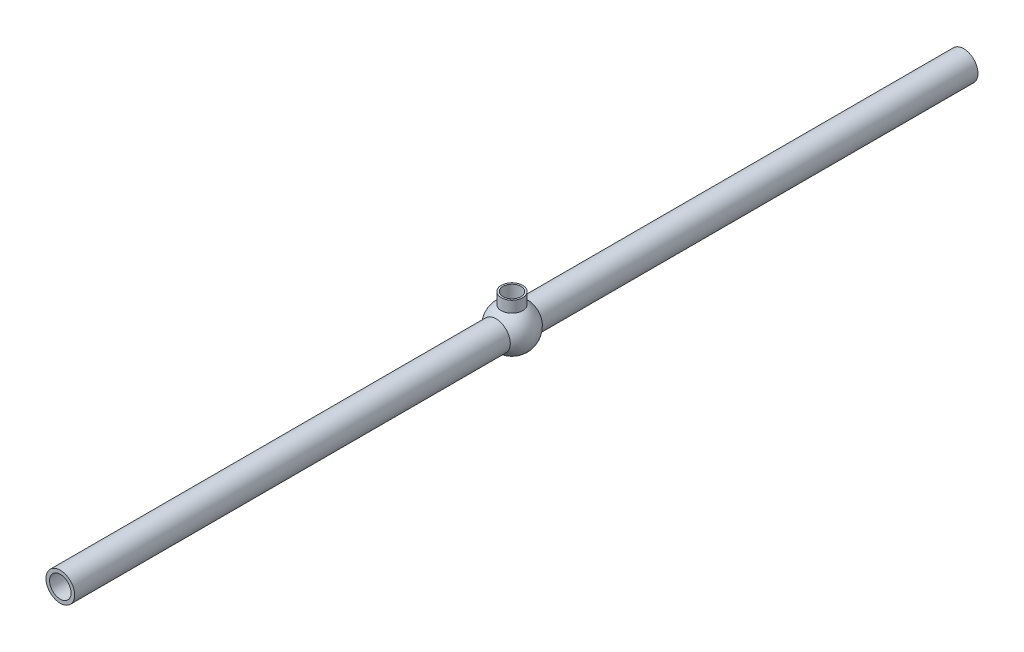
ISO-10303-21;
HEADER;
FILE_DESCRIPTION(('STEP AP214'),'2;1');
FILE_NAME('part.step','',(''),(''),'','','');
FILE_SCHEMA(('AUTOMOTIVE_DESIGN { 1 0 10303 214 1 1 1 1 }'));
ENDSEC;
DATA;
#1=APPLICATION_CONTEXT('core data for automotive mechanical design processes');
#2=APPLICATION_PROTOCOL_DEFINITION('international standard','automotive_design',2000,#1);
#3=PRODUCT_CONTEXT('',#1,'mechanical');
#4=PRODUCT('Part','Part','',(#3));
#5=PRODUCT_RELATED_PRODUCT_CATEGORY('part','',(#4));
#6=PRODUCT_DEFINITION_FORMATION('','',#4);
#7=PRODUCT_DEFINITION_CONTEXT('part definition',#1,'design');
#8=PRODUCT_DEFINITION('design','',#6,#7);
#9=PRODUCT_DEFINITION_SHAPE('','',#8);
#10=(LENGTH_UNIT() NAMED_UNIT(*) SI_UNIT(.MILLI.,.METRE.));
#11=(NAMED_UNIT(*) PLANE_ANGLE_UNIT() SI_UNIT($,.RADIAN.));
#12=(NAMED_UNIT(*) SI_UNIT($,.STERADIAN.) SOLID_ANGLE_UNIT());
#13=UNCERTAINTY_MEASURE_WITH_UNIT(LENGTH_MEASURE(1.E-05),#10,'distance_accuracy_value','');
#14=(GEOMETRIC_REPRESENTATION_CONTEXT(3) GLOBAL_UNCERTAINTY_ASSIGNED_CONTEXT((#13)) GLOBAL_UNIT_ASSIGNED_CONTEXT((#10,
#11,#12)) REPRESENTATION_CONTEXT('',''));
#15=CARTESIAN_POINT('',(0.,0.,0.));
#16=DIRECTION('',(0.,0.,1.));
#17=DIRECTION('',(1.,0.,0.));
#18=AXIS2_PLACEMENT_3D('',#15,#16,#17);
#19=CARTESIAN_POINT('',(0.,0.,0.));
#20=DIRECTION('',(0.,1.,0.));
#21=DIRECTION('',(1.,0.,0.));
#22=AXIS2_PLACEMENT_3D('',#19,#20,#21);
#23=SPHERICAL_SURFACE('',#22,30.);
#24=CARTESIAN_POINT('',(0.,25.9807621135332,0.));
#25=DIRECTION('',(0.,1.,0.));
#26=DIRECTION('',(-1.,0.,0.));
#27=AXIS2_PLACEMENT_3D('',#24,#25,#26);
#28=CIRCLE('',#27,14.9999999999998);
#29=CARTESIAN_POINT('',(-14.9999999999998,25.9807621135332,0.));
#30=VERTEX_POINT('',#29);
#31=EDGE_CURVE('E47',#30,#30,#28,.T.);
#32=ORIENTED_EDGE('',*,*,#31,.F.);
#33=EDGE_LOOP('',(#32));
#34=FACE_BOUND('',#33,.T.);
#35=CARTESIAN_POINT('',(0.,0.,22.3606797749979));
#36=DIRECTION('',(0.,0.,-1.));
#37=DIRECTION('',(-1.,0.,0.));
#38=AXIS2_PLACEMENT_3D('',#35,#36,#37);
#39=CIRCLE('',#38,20.);
#40=CARTESIAN_POINT('',(-20.,0.,22.3606797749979));
#41=VERTEX_POINT('',#40);
#42=EDGE_CURVE('E63',#41,#41,#39,.F.);
#43=ORIENTED_EDGE('',*,*,#42,.F.);
#44=EDGE_LOOP('',(#43));
#45=FACE_BOUND('',#44,.T.);
#46=CARTESIAN_POINT('',(0.,0.,-22.3606797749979));
#47=DIRECTION('',(0.,0.,1.));
#48=DIRECTION('',(1.,0.,0.));
#49=AXIS2_PLACEMENT_3D('',#46,#47,#48);
#50=CIRCLE('',#49,20.);
#51=CARTESIAN_POINT('',(20.,0.,-22.3606797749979));
#52=VERTEX_POINT('',#51);
#53=EDGE_CURVE('E11',#52,#52,#50,.F.);
#54=ORIENTED_EDGE('',*,*,#53,.F.);
#55=EDGE_LOOP('',(#54));
#56=FACE_BOUND('',#55,.T.);
#57=ADVANCED_FACE('F41',(#34,#45,#56),#23,.T.);
#58=CARTESIAN_POINT('',(0.,42.0067775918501,0.));
#59=DIRECTION('',(0.,1.,0.));
#60=DIRECTION('',(-1.,0.,0.));
#61=AXIS2_PLACEMENT_3D('',#58,#59,#60);
#62=CYLINDRICAL_SURFACE('',#61,14.9999999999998);
#63=CARTESIAN_POINT('',(0.,41.650635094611,0.));
#64=DIRECTION('',(0.,1.,0.));
#65=DIRECTION('',(-1.,0.,0.));
#66=AXIS2_PLACEMENT_3D('',#63,#64,#65);
#67=CIRCLE('',#66,14.9999999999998);
#68=CARTESIAN_POINT('',(-14.9999999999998,41.650635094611,0.));
#69=VERTEX_POINT('',#68);
#70=EDGE_CURVE('E51',#69,#69,#67,.T.);
#71=ORIENTED_EDGE('',*,*,#70,.F.);
#72=EDGE_LOOP('',(#71));
#73=FACE_BOUND('',#72,.T.);
#74=ORIENTED_EDGE('',*,*,#31,.T.);
#75=EDGE_LOOP('',(#74));
#76=FACE_BOUND('',#75,.T.);
#77=ADVANCED_FACE('F109',(#73,#76),#62,.T.);
#78=CARTESIAN_POINT('',(14.9999999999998,41.650635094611,0.));
#79=DIRECTION('',(0.,-1.,0.));
#80=DIRECTION('',(1.,0.,0.));
#81=AXIS2_PLACEMENT_3D('',#78,#79,#80);
#82=PLANE('',#81);
#83=CARTESIAN_POINT('',(0.,41.650635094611,0.));
#84=DIRECTION('',(0.,1.,0.));
#85=DIRECTION('',(-1.,0.,0.));
#86=AXIS2_PLACEMENT_3D('',#83,#84,#85);
#87=CIRCLE('',#86,12.4999999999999);
#88=CARTESIAN_POINT('',(-12.4999999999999,41.650635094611,0.));
#89=VERTEX_POINT('',#88);
#90=EDGE_CURVE('E56',#89,#89,#87,.T.);
#91=ORIENTED_EDGE('',*,*,#90,.F.);
#92=EDGE_LOOP('',(#91));
#93=FACE_BOUND('',#92,.T.);
#94=ORIENTED_EDGE('',*,*,#70,.T.);
#95=EDGE_LOOP('',(#94));
#96=FACE_BOUND('',#95,.T.);
#97=ADVANCED_FACE('F114',(#93,#96),#82,.F.);
#98=CARTESIAN_POINT('',(0.,42.0067775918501,0.));
#99=DIRECTION('',(0.,1.,0.));
#100=DIRECTION('',(-1.,0.,0.));
#101=AXIS2_PLACEMENT_3D('',#98,#99,#100);
#102=CYLINDRICAL_SURFACE('',#101,12.4999999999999);
#103=CARTESIAN_POINT('',(0.,21.650635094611,0.));
#104=DIRECTION('',(0.,1.,0.));
#105=DIRECTION('',(-1.,0.,0.));
#106=AXIS2_PLACEMENT_3D('',#103,#104,#105);
#107=CIRCLE('',#106,12.4999999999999);
#108=CARTESIAN_POINT('',(-12.4999999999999,21.650635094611,0.));
#109=VERTEX_POINT('',#108);
#110=EDGE_CURVE('E65',#109,#109,#107,.T.);
#111=ORIENTED_EDGE('',*,*,#110,.F.);
#112=EDGE_LOOP('',(#111));
#113=FACE_BOUND('',#112,.T.);
#114=ORIENTED_EDGE('',*,*,#90,.T.);
#115=EDGE_LOOP('',(#114));
#116=FACE_BOUND('',#115,.T.);
#117=ADVANCED_FACE('F104',(#113,#116),#102,.F.);
#118=CARTESIAN_POINT('',(0.,0.,0.));
#119=DIRECTION('',(0.,1.,0.));
#120=DIRECTION('',(1.,0.,0.));
#121=AXIS2_PLACEMENT_3D('',#118,#119,#120);
#122=SPHERICAL_SURFACE('',#121,25.);
#123=CARTESIAN_POINT('',(0.,0.,20.));
#124=DIRECTION('',(0.,0.,-1.));
#125=DIRECTION('',(-1.,0.,0.));
#126=AXIS2_PLACEMENT_3D('',#123,#124,#125);
#127=CIRCLE('',#126,15.);
#128=CARTESIAN_POINT('',(15.,0.,20.));
#129=VERTEX_POINT('',#128);
#130=EDGE_CURVE('E62',#129,#129,#127,.F.);
#131=ORIENTED_EDGE('',*,*,#130,.T.);
#132=EDGE_LOOP('',(#131));
#133=FACE_BOUND('',#132,.T.);
#134=CARTESIAN_POINT('',(0.,0.,-20.));
#135=DIRECTION('',(0.,0.,1.));
#136=DIRECTION('',(1.,0.,0.));
#137=AXIS2_PLACEMENT_3D('',#134,#135,#136);
#138=CIRCLE('',#137,15.);
#139=CARTESIAN_POINT('',(15.,0.,-20.));
#140=VERTEX_POINT('',#139);
#141=EDGE_CURVE('E60',#140,#140,#138,.F.);
#142=ORIENTED_EDGE('',*,*,#141,.T.);
#143=EDGE_LOOP('',(#142));
#144=FACE_BOUND('',#143,.T.);
#145=ORIENTED_EDGE('',*,*,#110,.T.);
#146=EDGE_LOOP('',(#145));
#147=FACE_BOUND('',#146,.T.);
#148=ADVANCED_FACE('F95',(#133,#144,#147),#122,.F.);
#149=CARTESIAN_POINT('',(0.,0.,-30.));
#150=DIRECTION('',(0.,0.,1.));
#151=DIRECTION('',(1.,0.,0.));
#152=AXIS2_PLACEMENT_3D('',#149,#150,#151);
#153=CYLINDRICAL_SURFACE('',#152,15.);
#154=CARTESIAN_POINT('',(0.,0.,-630.));
#155=DIRECTION('',(0.,0.,1.));
#156=DIRECTION('',(1.,0.,0.));
#157=AXIS2_PLACEMENT_3D('',#154,#155,#156);
#158=CIRCLE('',#157,15.);
#159=CARTESIAN_POINT('',(15.,0.,-630.));
#160=VERTEX_POINT('',#159);
#161=EDGE_CURVE('E85',#160,#160,#158,.T.);
#162=CARTESIAN_POINT('',(15.,0.,-20.));
#163=CARTESIAN_POINT('',(15.,0.,-26.3541666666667));
#164=CARTESIAN_POINT('',(15.,0.,-32.7083333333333));
#165=CARTESIAN_POINT('',(15.,0.,-45.4166666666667));
#166=CARTESIAN_POINT('',(15.,0.,-51.7708333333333));
#167=CARTESIAN_POINT('',(15.,0.,-64.4791666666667));
#168=CARTESIAN_POINT('',(15.,0.,-70.8333333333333));
#169=CARTESIAN_POINT('',(15.,0.,-83.5416666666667));
#170=CARTESIAN_POINT('',(15.,0.,-89.8958333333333));
#171=CARTESIAN_POINT('',(15.,0.,-102.604166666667));
#172=CARTESIAN_POINT('',(15.,0.,-108.958333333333));
#173=CARTESIAN_POINT('',(15.,0.,-121.666666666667));
#174=CARTESIAN_POINT('',(15.,0.,-128.020833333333));
#175=CARTESIAN_POINT('',(15.,0.,-140.729166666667));
#176=CARTESIAN_POINT('',(15.,0.,-147.083333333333));
#177=CARTESIAN_POINT('',(15.,0.,-159.791666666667));
#178=CARTESIAN_POINT('',(15.,0.,-166.145833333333));
#179=CARTESIAN_POINT('',(15.,0.,-178.854166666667));
#180=CARTESIAN_POINT('',(15.,0.,-185.208333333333));
#181=CARTESIAN_POINT('',(15.,0.,-197.916666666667));
#182=CARTESIAN_POINT('',(15.,0.,-204.270833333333));
#183=CARTESIAN_POINT('',(15.,0.,-216.979166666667));
#184=CARTESIAN_POINT('',(15.,0.,-223.333333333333));
#185=CARTESIAN_POINT('',(15.,0.,-236.041666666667));
#186=CARTESIAN_POINT('',(15.,0.,-242.395833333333));
#187=CARTESIAN_POINT('',(15.,0.,-255.104166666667));
#188=CARTESIAN_POINT('',(15.,0.,-261.458333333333));
#189=CARTESIAN_POINT('',(15.,0.,-274.166666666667));
#190=CARTESIAN_POINT('',(15.,0.,-280.520833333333));
#191=CARTESIAN_POINT('',(15.,0.,-293.229166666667));
#192=CARTESIAN_POINT('',(15.,0.,-299.583333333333));
#193=CARTESIAN_POINT('',(15.,0.,-312.291666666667));
#194=CARTESIAN_POINT('',(15.,0.,-318.645833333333));
#195=CARTESIAN_POINT('',(15.,0.,-331.354166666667));
#196=CARTESIAN_POINT('',(15.,0.,-337.708333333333));
#197=CARTESIAN_POINT('',(15.,0.,-350.416666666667));
#198=CARTESIAN_POINT('',(15.,0.,-356.770833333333));
#199=CARTESIAN_POINT('',(15.,0.,-369.479166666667));
#200=CARTESIAN_POINT('',(15.,0.,-375.833333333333));
#201=CARTESIAN_POINT('',(15.,0.,-388.541666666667));
#202=CARTESIAN_POINT('',(15.,0.,-394.895833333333));
#203=CARTESIAN_POINT('',(15.,0.,-407.604166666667));
#204=CARTESIAN_POINT('',(15.,0.,-413.958333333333));
#205=CARTESIAN_POINT('',(15.,0.,-426.666666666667));
#206=CARTESIAN_POINT('',(15.,0.,-433.020833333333));
#207=CARTESIAN_POINT('',(15.,0.,-445.729166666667));
#208=CARTESIAN_POINT('',(15.,0.,-452.083333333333));
#209=CARTESIAN_POINT('',(15.,0.,-464.791666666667));
#210=CARTESIAN_POINT('',(15.,0.,-471.145833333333));
#211=CARTESIAN_POINT('',(15.,0.,-483.854166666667));
#212=CARTESIAN_POINT('',(15.,0.,-490.208333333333));
#213=CARTESIAN_POINT('',(15.,0.,-502.916666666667));
#214=CARTESIAN_POINT('',(15.,0.,-509.270833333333));
#215=CARTESIAN_POINT('',(15.,0.,-521.979166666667));
#216=CARTESIAN_POINT('',(15.,0.,-528.333333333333));
#217=CARTESIAN_POINT('',(15.,0.,-541.041666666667));
#218=CARTESIAN_POINT('',(15.,0.,-547.395833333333));
#219=CARTESIAN_POINT('',(15.,0.,-560.104166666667));
#220=CARTESIAN_POINT('',(15.,0.,-566.458333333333));
#221=CARTESIAN_POINT('',(15.,0.,-579.166666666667));
#222=CARTESIAN_POINT('',(15.,0.,-585.520833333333));
#223=CARTESIAN_POINT('',(15.,0.,-598.229166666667));
#224=CARTESIAN_POINT('',(15.,0.,-604.583333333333));
#225=CARTESIAN_POINT('',(15.,0.,-617.291666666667));
#226=CARTESIAN_POINT('',(15.,0.,-623.645833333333));
#227=CARTESIAN_POINT('',(15.,0.,-630.));
#228=B_SPLINE_CURVE_WITH_KNOTS('',3,(#162,#163,#164,#165,#166,#167,#168,#169,#170,#171,#172,
#173,#174,#175,#176,#177,#178,#179,#180,#181,#182,#183,#184,#185,#186,#187,#188,#189,#190,#191,
#192,#193,#194,#195,#196,#197,#198,#199,#200,#201,#202,#203,#204,#205,#206,#207,#208,#209,#210,
#211,#212,#213,#214,#215,#216,#217,#218,#219,#220,#221,#222,#223,#224,#225,#226,#227),
.UNSPECIFIED.,.F.,.F.,(4,2,2,2,2,2,2,2,2,2,2,2,2,2,2,2,2,2,2,2,2,2,2,2,2,2,2,2,2,2,2,2,4),(0.,
19.0625,38.125,57.1875,76.25,95.3125,114.375,133.4375,152.5,171.5625,190.625,209.6875,228.75,
247.8125,266.875,285.9375,305.,324.0625,343.125,362.1875,381.25,400.3125,419.375,438.4375,457.5,
476.5625,495.625,514.6875,533.75,552.8125,571.875,590.9375,610.),.UNSPECIFIED.);
#229=EDGE_CURVE('BSEAM92',#140,#160,#228,.T.);
#230=ORIENTED_EDGE('',*,*,#141,.F.);
#231=ORIENTED_EDGE('',*,*,#161,.F.);
#232=ORIENTED_EDGE('',*,*,#229,.T.);
#233=ORIENTED_EDGE('',*,*,#229,.F.);
#234=EDGE_LOOP('',(#230,#232,#231,#233));
#235=FACE_BOUND('',#234,.T.);
#236=ADVANCED_FACE('F92',(#235),#153,.F.);
#237=CARTESIAN_POINT('',(0.,0.,630.));
#238=DIRECTION('',(0.,0.,1.));
#239=DIRECTION('',(1.,0.,0.));
#240=AXIS2_PLACEMENT_3D('',#237,#238,#239);
#241=CIRCLE('',#240,15.);
#242=CARTESIAN_POINT('',(15.,0.,630.));
#243=VERTEX_POINT('',#242);
#244=EDGE_CURVE('E79',#243,#243,#241,.T.);
#245=CARTESIAN_POINT('',(15.,0.,20.));
#246=CARTESIAN_POINT('',(15.,0.,26.3541666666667));
#247=CARTESIAN_POINT('',(15.,0.,32.7083333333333));
#248=CARTESIAN_POINT('',(15.,0.,45.4166666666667));
#249=CARTESIAN_POINT('',(15.,0.,51.7708333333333));
#250=CARTESIAN_POINT('',(15.,0.,64.4791666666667));
#251=CARTESIAN_POINT('',(15.,0.,70.8333333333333));
#252=CARTESIAN_POINT('',(15.,0.,83.5416666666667));
#253=CARTESIAN_POINT('',(15.,0.,89.8958333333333));
#254=CARTESIAN_POINT('',(15.,0.,102.604166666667));
#255=CARTESIAN_POINT('',(15.,0.,108.958333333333));
#256=CARTESIAN_POINT('',(15.,0.,121.666666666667));
#257=CARTESIAN_POINT('',(15.,0.,128.020833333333));
#258=CARTESIAN_POINT('',(15.,0.,140.729166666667));
#259=CARTESIAN_POINT('',(15.,0.,147.083333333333));
#260=CARTESIAN_POINT('',(15.,0.,159.791666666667));
#261=CARTESIAN_POINT('',(15.,0.,166.145833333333));
#262=CARTESIAN_POINT('',(15.,0.,178.854166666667));
#263=CARTESIAN_POINT('',(15.,0.,185.208333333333));
#264=CARTESIAN_POINT('',(15.,0.,197.916666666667));
#265=CARTESIAN_POINT('',(15.,0.,204.270833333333));
#266=CARTESIAN_POINT('',(15.,0.,216.979166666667));
#267=CARTESIAN_POINT('',(15.,0.,223.333333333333));
#268=CARTESIAN_POINT('',(15.,0.,236.041666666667));
#269=CARTESIAN_POINT('',(15.,0.,242.395833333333));
#270=CARTESIAN_POINT('',(15.,0.,255.104166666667));
#271=CARTESIAN_POINT('',(15.,0.,261.458333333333));
#272=CARTESIAN_POINT('',(15.,0.,274.166666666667));
#273=CARTESIAN_POINT('',(15.,0.,280.520833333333));
#274=CARTESIAN_POINT('',(15.,0.,293.229166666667));
#275=CARTESIAN_POINT('',(15.,0.,299.583333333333));
#276=CARTESIAN_POINT('',(15.,0.,312.291666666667));
#277=CARTESIAN_POINT('',(15.,0.,318.645833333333));
#278=CARTESIAN_POINT('',(15.,0.,331.354166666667));
#279=CARTESIAN_POINT('',(15.,0.,337.708333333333));
#280=CARTESIAN_POINT('',(15.,0.,350.416666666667));
#281=CARTESIAN_POINT('',(15.,0.,356.770833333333));
#282=CARTESIAN_POINT('',(15.,0.,369.479166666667));
#283=CARTESIAN_POINT('',(15.,0.,375.833333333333));
#284=CARTESIAN_POINT('',(15.,0.,388.541666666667));
#285=CARTESIAN_POINT('',(15.,0.,394.895833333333));
#286=CARTESIAN_POINT('',(15.,0.,407.604166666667));
#287=CARTESIAN_POINT('',(15.,0.,413.958333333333));
#288=CARTESIAN_POINT('',(15.,0.,426.666666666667));
#289=CARTESIAN_POINT('',(15.,0.,433.020833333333));
#290=CARTESIAN_POINT('',(15.,0.,445.729166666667));
#291=CARTESIAN_POINT('',(15.,0.,452.083333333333));
#292=CARTESIAN_POINT('',(15.,0.,464.791666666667));
#293=CARTESIAN_POINT('',(15.,0.,471.145833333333));
#294=CARTESIAN_POINT('',(15.,0.,483.854166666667));
#295=CARTESIAN_POINT('',(15.,0.,490.208333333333));
#296=CARTESIAN_POINT('',(15.,0.,502.916666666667));
#297=CARTESIAN_POINT('',(15.,0.,509.270833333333));
#298=CARTESIAN_POINT('',(15.,0.,521.979166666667));
#299=CARTESIAN_POINT('',(15.,0.,528.333333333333));
#300=CARTESIAN_POINT('',(15.,0.,541.041666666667));
#301=CARTESIAN_POINT('',(15.,0.,547.395833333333));
#302=CARTESIAN_POINT('',(15.,0.,560.104166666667));
#303=CARTESIAN_POINT('',(15.,0.,566.458333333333));
#304=CARTESIAN_POINT('',(15.,0.,579.166666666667));
#305=CARTESIAN_POINT('',(15.,0.,585.520833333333));
#306=CARTESIAN_POINT('',(15.,0.,598.229166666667));
#307=CARTESIAN_POINT('',(15.,0.,604.583333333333));
#308=CARTESIAN_POINT('',(15.,0.,617.291666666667));
#309=CARTESIAN_POINT('',(15.,0.,623.645833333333));
#310=CARTESIAN_POINT('',(15.,0.,630.));
#311=B_SPLINE_CURVE_WITH_KNOTS('',3,(#245,#246,#247,#248,#249,#250,#251,#252,#253,#254,#255,
#256,#257,#258,#259,#260,#261,#262,#263,#264,#265,#266,#267,#268,#269,#270,#271,#272,#273,#274,
#275,#276,#277,#278,#279,#280,#281,#282,#283,#284,#285,#286,#287,#288,#289,#290,#291,#292,#293,
#294,#295,#296,#297,#298,#299,#300,#301,#302,#303,#304,#305,#306,#307,#308,#309,#310),
.UNSPECIFIED.,.F.,.F.,(4,2,2,2,2,2,2,2,2,2,2,2,2,2,2,2,2,2,2,2,2,2,2,2,2,2,2,2,2,2,2,2,4),(0.,
19.0625,38.125,57.1875,76.25,95.3125,114.375,133.4375,152.5,171.5625,190.625,209.6875,228.75,
247.8125,266.875,285.9375,305.,324.0625,343.125,362.1875,381.25,400.3125,419.375,438.4375,457.5,
476.5625,495.625,514.6875,533.75,552.8125,571.875,590.9375,610.),.UNSPECIFIED.);
#312=EDGE_CURVE('BSEAM94',#129,#243,#311,.T.);
#313=ORIENTED_EDGE('',*,*,#130,.F.);
#314=ORIENTED_EDGE('',*,*,#244,.T.);
#315=ORIENTED_EDGE('',*,*,#312,.T.);
#316=ORIENTED_EDGE('',*,*,#312,.F.);
#317=EDGE_LOOP('',(#313,#315,#314,#316));
#318=FACE_BOUND('',#317,.T.);
#319=ADVANCED_FACE('F94',(#318),#153,.F.);
#320=CARTESIAN_POINT('',(0.,0.,-500000.));
#321=DIRECTION('',(0.,0.,1.));
#322=DIRECTION('',(1.,0.,0.));
#323=AXIS2_PLACEMENT_3D('',#320,#321,#322);
#324=CYLINDRICAL_SURFACE('',#323,20.);
#325=ORIENTED_EDGE('',*,*,#42,.T.);
#326=EDGE_LOOP('',(#325));
#327=FACE_BOUND('',#326,.T.);
#328=CARTESIAN_POINT('',(0.,0.,630.));
#329=DIRECTION('',(0.,0.,1.));
#330=DIRECTION('',(1.,0.,0.));
#331=AXIS2_PLACEMENT_3D('',#328,#329,#330);
#332=CIRCLE('',#331,20.);
#333=CARTESIAN_POINT('',(20.,0.,630.));
#334=VERTEX_POINT('',#333);
#335=EDGE_CURVE('E76',#334,#334,#332,.T.);
#336=ORIENTED_EDGE('',*,*,#335,.F.);
#337=EDGE_LOOP('',(#336));
#338=FACE_BOUND('',#337,.T.);
#339=ADVANCED_FACE('F102',(#327,#338),#324,.T.);
#340=CARTESIAN_POINT('',(0.,0.,630.));
#341=DIRECTION('',(0.,0.,1.));
#342=DIRECTION('',(1.,0.,0.));
#343=AXIS2_PLACEMENT_3D('',#340,#341,#342);
#344=PLANE('',#343);
#345=ORIENTED_EDGE('',*,*,#335,.T.);
#346=EDGE_LOOP('',(#345));
#347=FACE_BOUND('',#346,.T.);
#348=ORIENTED_EDGE('',*,*,#244,.F.);
#349=EDGE_LOOP('',(#348));
#350=FACE_BOUND('',#349,.T.);
#351=ADVANCED_FACE('F122',(#347,#350),#344,.T.);
#352=CARTESIAN_POINT('',(0.,0.,500000.));
#353=DIRECTION('',(0.,0.,-1.));
#354=DIRECTION('',(-1.,0.,0.));
#355=AXIS2_PLACEMENT_3D('',#352,#353,#354);
#356=CYLINDRICAL_SURFACE('',#355,20.);
#357=ORIENTED_EDGE('',*,*,#53,.T.);
#358=EDGE_LOOP('',(#357));
#359=FACE_BOUND('',#358,.T.);
#360=CARTESIAN_POINT('',(0.,0.,-630.));
#361=DIRECTION('',(0.,0.,1.));
#362=DIRECTION('',(1.,0.,0.));
#363=AXIS2_PLACEMENT_3D('',#360,#361,#362);
#364=CIRCLE('',#363,20.);
#365=CARTESIAN_POINT('',(20.,0.,-630.));
#366=VERTEX_POINT('',#365);
#367=EDGE_CURVE('E82',#366,#366,#364,.T.);
#368=ORIENTED_EDGE('',*,*,#367,.T.);
#369=EDGE_LOOP('',(#368));
#370=FACE_BOUND('',#369,.T.);
#371=ADVANCED_FACE('F127',(#359,#370),#356,.T.);
#372=CARTESIAN_POINT('',(0.,0.,-630.));
#373=DIRECTION('',(0.,0.,1.));
#374=DIRECTION('',(1.,0.,0.));
#375=AXIS2_PLACEMENT_3D('',#372,#373,#374);
#376=PLANE('',#375);
#377=ORIENTED_EDGE('',*,*,#161,.T.);
#378=EDGE_LOOP('',(#377));
#379=FACE_BOUND('',#378,.T.);
#380=ORIENTED_EDGE('',*,*,#367,.F.);
#381=EDGE_LOOP('',(#380));
#382=FACE_BOUND('',#381,.T.);
#383=ADVANCED_FACE('F89',(#379,#382),#376,.F.);
#384=CLOSED_SHELL('',(#57,#77,#97,#117,#148,#236,#319,#339,#351,#371,#383));
#385=MANIFOLD_SOLID_BREP('B2',#384);
#386=ADVANCED_BREP_SHAPE_REPRESENTATION('',(#18,#385),#14);
#387=SHAPE_DEFINITION_REPRESENTATION(#9,#386);
ENDSEC;
END-ISO-10303-21;
